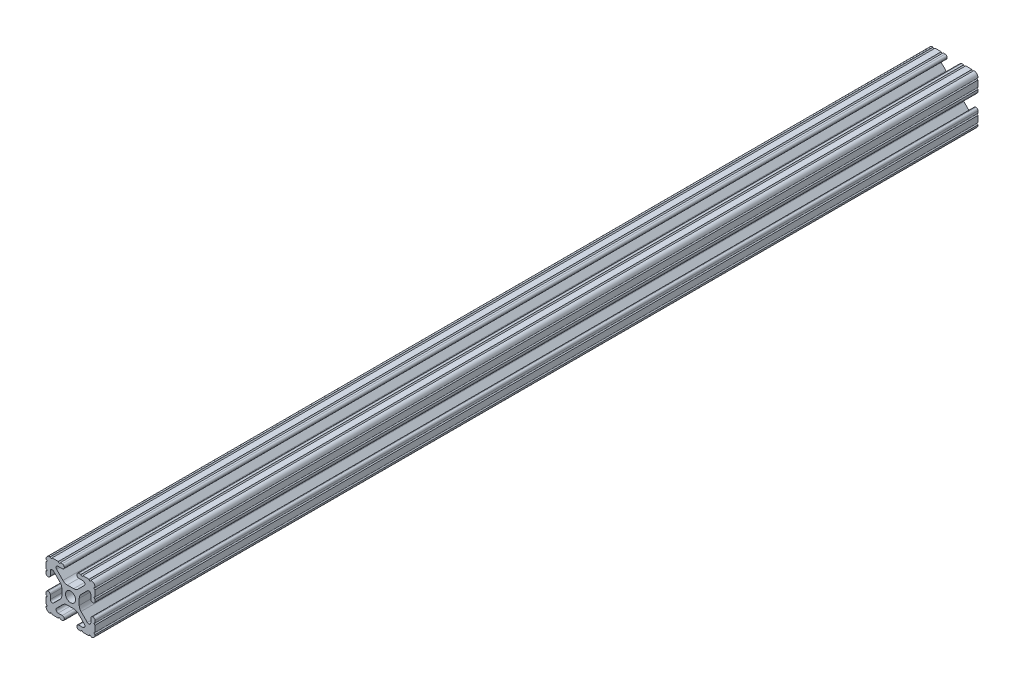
from build123d import *

# Parameters (mm, degrees)
SKETCH1_R               = 2.6035
BOSS_EXTRUDE1_DEPTH     = 304.8
CUT_EXTRUDE1_DEPTH      = 306.328708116
CUT_EXTRUDE1_DEPTH_BACK = 306.328708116
SKETCH2_W               = 152.4
SKETCH2_H               = 46.544775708


with BuildPart() as part:
    # Sketch1 → Boss-Extrude1 (new, symmetric)
    with BuildSketch(Plane.XY):
        with BuildLine():
            Line((-7.179650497, -8.645192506), (-3.952270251, -5.423690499))
            ThreePointArc((-3.952270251, -5.423690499), (-2.922936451, -4.736929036), (-1.709253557, -4.4958))
            Line((-1.709253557, -4.4958), (1.709253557, -4.4958))
            ThreePointArc((1.709253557, -4.4958), (2.922936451, -4.736929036), (3.952270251, -5.423690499))
            Line((3.952270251, -5.423690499), (7.179650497, -8.645192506))
            ThreePointArc((7.179650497, -8.645192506), (7.41473083, -9.822813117), (6.416408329, -10.4902))
            Line((6.416408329, -10.4902), (4.287512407, -10.4902))
            ThreePointArc((4.287512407, -10.4902), (3.54574862, -10.79744862), (3.2385, -11.539212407))
            Line((3.2385, -11.539212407), (3.2385, -11.650987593))
            ThreePointArc((3.2385, -11.650987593), (3.54574862, -12.39275138), (4.287512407, -12.7))
            Line((4.287512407, -12.7), (5.317126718, -12.7))
            ThreePointArc((5.317126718, -12.7), (5.825126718, -12.192), (6.333126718, -12.7))
            Line((6.333126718, -12.7), (9.550443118, -12.7))
            ThreePointArc((9.550443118, -12.7), (10.058366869, -12.192000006), (10.566443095, -12.699847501))
            ThreePointArc((10.566443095, -12.699847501), (12.082537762, -12.08250727), (12.699846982, -10.566399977))
            ThreePointArc((12.699846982, -10.566399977), (12.192000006, -10.058323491), (12.7, -9.5504))
            Line((12.7, -9.5504), (12.7, -6.3330836))
            ThreePointArc((12.7, -6.3330836), (12.192, -5.8250836), (12.7, -5.3170836))
            Line((12.7, -5.3170836), (12.7, -4.287469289))
            ThreePointArc((12.7, -4.287469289), (12.39275138, -3.545705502), (11.650987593, -3.238456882))
            Line((11.650987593, -3.238456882), (11.539212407, -3.238456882))
            ThreePointArc((11.539212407, -3.238456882), (10.79744862, -3.545705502), (10.4902, -4.287469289))
            Line((10.4902, -4.287469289), (10.4902, -6.402089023))
            ThreePointArc((10.4902, -6.402089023), (9.856505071, -7.351067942), (8.737131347, -7.129408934))
            Line((8.737131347, -7.129408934), (5.441005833, -3.840816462))
            ThreePointArc((5.441005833, -3.840816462), (4.750877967, -2.809883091), (4.5085, -1.593185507))
            Line((4.5085, -1.593185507), (4.5085, 1.593185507))
            ThreePointArc((4.5085, 1.593185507), (4.750877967, 2.809883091), (5.441005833, 3.840816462))
            Line((5.441005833, 3.840816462), (8.737131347, 7.129408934))
            ThreePointArc((8.737131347, 7.129408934), (9.856505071, 7.351067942), (10.4902, 6.402089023))
            Line((10.4902, 6.402089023), (10.4902, 4.287469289))
            ThreePointArc((10.4902, 4.287469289), (10.79744862, 3.545705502), (11.539212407, 3.238456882))
            Line((11.539212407, 3.238456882), (11.650987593, 3.238456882))
            ThreePointArc((11.650987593, 3.238456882), (12.39275138, 3.545705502), (12.7, 4.287469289))
            Line((12.7, 4.287469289), (12.7, 5.3170836))
            ThreePointArc((12.7, 5.3170836), (12.192, 5.8250836), (12.7, 6.3330836))
            Line((12.7, 6.3330836), (12.7, 9.5504))
            ThreePointArc((12.7, 9.5504), (12.192000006, 10.058323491), (12.699846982, 10.566399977))
            ThreePointArc((12.699846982, 10.566399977), (12.082537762, 12.08250727), (10.566443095, 12.699847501))
            ThreePointArc((10.566443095, 12.699847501), (10.058366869, 12.192000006), (9.550443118, 12.7))
            Line((9.550443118, 12.7), (6.333126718, 12.7))
            ThreePointArc((6.333126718, 12.7), (5.825126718, 12.192), (5.317126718, 12.7))
            Line((5.317126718, 12.7), (4.287512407, 12.7))
            ThreePointArc((4.287512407, 12.7), (3.54574862, 12.39275138), (3.2385, 11.650987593))
            Line((3.2385, 11.650987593), (3.2385, 11.539212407))
            ThreePointArc((3.2385, 11.539212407), (3.54574862, 10.79744862), (4.287512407, 10.4902))
            Line((4.287512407, 10.4902), (6.476788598, 10.4902))
            ThreePointArc((6.476788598, 10.4902), (7.432222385, 9.85140422), (7.207036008, 8.724370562))
            Line((7.207036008, 8.724370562), (3.898272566, 5.423169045))
            ThreePointArc((3.898272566, 5.423169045), (2.869120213, 4.736787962), (1.655778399, 4.4958))
            Line((1.655778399, 4.4958), (-1.655778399, 4.4958))
            ThreePointArc((-1.655778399, 4.4958), (-2.869120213, 4.736787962), (-3.898272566, 5.423169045))
            Line((-3.898272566, 5.423169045), (-7.207036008, 8.724370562))
            ThreePointArc((-7.207036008, 8.724370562), (-7.432222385, 9.85140422), (-6.476788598, 10.4902))
            Line((-6.476788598, 10.4902), (-4.287512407, 10.4902))
            ThreePointArc((-4.287512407, 10.4902), (-3.54574862, 10.79744862), (-3.2385, 11.539212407))
            Line((-3.2385, 11.539212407), (-3.2385, 11.650987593))
            ThreePointArc((-3.2385, 11.650987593), (-3.54574862, 12.39275138), (-4.287512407, 12.7))
            Line((-4.287512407, 12.7), (-5.317126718, 12.7))
            ThreePointArc((-5.317126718, 12.7), (-5.825126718, 12.192), (-6.333126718, 12.7))
            Line((-6.333126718, 12.7), (-9.550443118, 12.7))
            ThreePointArc((-9.550443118, 12.7), (-10.058366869, 12.192000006), (-10.566443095, 12.699847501))
            ThreePointArc((-10.566443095, 12.699847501), (-12.082537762, 12.08250727), (-12.699846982, 10.566399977))
            ThreePointArc((-12.699846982, 10.566399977), (-12.192000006, 10.058323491), (-12.7, 9.5504))
            Line((-12.7, 9.5504), (-12.7, 6.3330836))
            ThreePointArc((-12.7, 6.3330836), (-12.192, 5.8250836), (-12.7, 5.3170836))
            Line((-12.7, 5.3170836), (-12.7, 4.287469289))
            ThreePointArc((-12.7, 4.287469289), (-12.39275138, 3.545705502), (-11.650987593, 3.238456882))
            Line((-11.650987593, 3.238456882), (-11.539212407, 3.238456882))
            ThreePointArc((-11.539212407, 3.238456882), (-10.79744862, 3.545705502), (-10.4902, 4.287469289))
            Line((-10.4902, 4.287469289), (-10.4902, 6.402089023))
            ThreePointArc((-10.4902, 6.402089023), (-9.856505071, 7.351067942), (-8.737131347, 7.129408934))
            Line((-8.737131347, 7.129408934), (-5.441005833, 3.840816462))
            ThreePointArc((-5.441005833, 3.840816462), (-4.750877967, 2.809883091), (-4.5085, 1.593185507))
            Line((-4.5085, 1.593185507), (-4.5085, -1.593185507))
            ThreePointArc((-4.5085, -1.593185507), (-4.750877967, -2.809883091), (-5.441005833, -3.840816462))
            Line((-5.441005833, -3.840816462), (-8.737131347, -7.129408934))
            ThreePointArc((-8.737131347, -7.129408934), (-9.856505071, -7.351067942), (-10.4902, -6.402089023))
            Line((-10.4902, -6.402089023), (-10.4902, -4.287469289))
            ThreePointArc((-10.4902, -4.287469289), (-10.79744862, -3.545705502), (-11.539212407, -3.238456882))
            Line((-11.539212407, -3.238456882), (-11.650987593, -3.238456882))
            ThreePointArc((-11.650987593, -3.238456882), (-12.39275138, -3.545705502), (-12.7, -4.287469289))
            Line((-12.7, -4.287469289), (-12.7, -5.3170836))
            ThreePointArc((-12.7, -5.3170836), (-12.192, -5.8250836), (-12.7, -6.3330836))
            Line((-12.7, -6.3330836), (-12.7, -9.5504))
            ThreePointArc((-12.7, -9.5504), (-12.192000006, -10.058323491), (-12.699846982, -10.566399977))
            ThreePointArc((-12.699846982, -10.566399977), (-12.082537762, -12.08250727), (-10.566443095, -12.699847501))
            ThreePointArc((-10.566443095, -12.699847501), (-10.058366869, -12.192000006), (-9.550443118, -12.7))
            Line((-9.550443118, -12.7), (-6.333126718, -12.7))
            ThreePointArc((-6.333126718, -12.7), (-5.825126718, -12.192), (-5.317126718, -12.7))
            Line((-5.317126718, -12.7), (-4.287512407, -12.7))
            ThreePointArc((-4.287512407, -12.7), (-3.54574862, -12.39275138), (-3.2385, -11.650987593))
            Line((-3.2385, -11.650987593), (-3.2385, -11.539212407))
            ThreePointArc((-3.2385, -11.539212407), (-3.54574862, -10.79744862), (-4.287512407, -10.4902))
            Line((-4.287512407, -10.4902), (-6.416408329, -10.4902))
            ThreePointArc((-6.416408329, -10.4902), (-7.41473083, -9.822813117), (-7.179650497, -8.645192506))
        make_face()
        with Locations(Location((0, 0, 0), (0, 0, 180))):
            Circle(SKETCH1_R, mode=Mode.SUBTRACT)
    extrude(amount=BOSS_EXTRUDE1_DEPTH, both=True)

    # Sketch2 → Cut-Extrude1 (cut, two sides: drawn at the far end of the back side and taken through both)
    with BuildSketch(Plane(origin=(0, 0, 0), x_dir=(0, 0, -1), z_dir=(1, 0, 0)).offset(-CUT_EXTRUDE1_DEPTH_BACK)):
        with Locations((228.6, -4.672813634)):
            Rectangle(SKETCH2_W, SKETCH2_H)
    extrude(amount=CUT_EXTRUDE1_DEPTH + CUT_EXTRUDE1_DEPTH_BACK, mode=Mode.SUBTRACT)


solid = part.part
